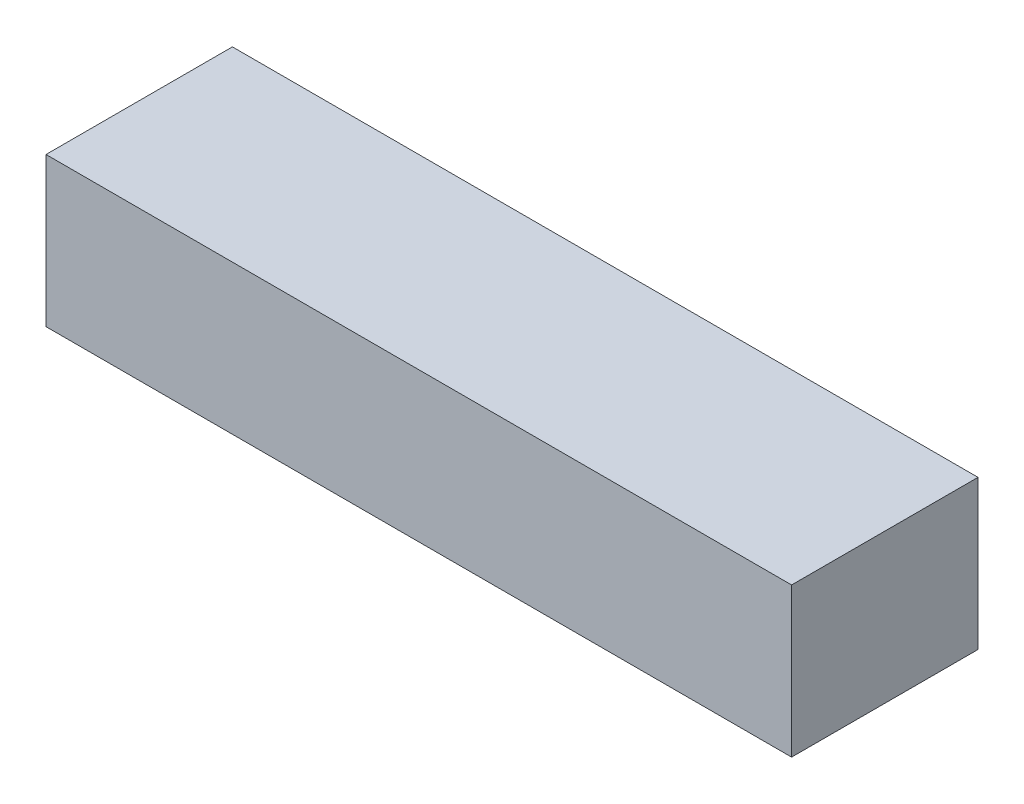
ISO-10303-21;
HEADER;
FILE_DESCRIPTION(('STEP AP214'),'2;1');
FILE_NAME('part.step','',(''),(''),'','','');
FILE_SCHEMA(('AUTOMOTIVE_DESIGN { 1 0 10303 214 1 1 1 1 }'));
ENDSEC;
DATA;
#1=APPLICATION_CONTEXT('core data for automotive mechanical design processes');
#2=APPLICATION_PROTOCOL_DEFINITION('international standard','automotive_design',2000,#1);
#3=PRODUCT_CONTEXT('',#1,'mechanical');
#4=PRODUCT('Part','Part','',(#3));
#5=PRODUCT_RELATED_PRODUCT_CATEGORY('part','',(#4));
#6=PRODUCT_DEFINITION_FORMATION('','',#4);
#7=PRODUCT_DEFINITION_CONTEXT('part definition',#1,'design');
#8=PRODUCT_DEFINITION('design','',#6,#7);
#9=PRODUCT_DEFINITION_SHAPE('','',#8);
#10=(LENGTH_UNIT() NAMED_UNIT(*) SI_UNIT(.MILLI.,.METRE.));
#11=(NAMED_UNIT(*) PLANE_ANGLE_UNIT() SI_UNIT($,.RADIAN.));
#12=(NAMED_UNIT(*) SI_UNIT($,.STERADIAN.) SOLID_ANGLE_UNIT());
#13=UNCERTAINTY_MEASURE_WITH_UNIT(LENGTH_MEASURE(1.E-05),#10,'distance_accuracy_value','');
#14=(GEOMETRIC_REPRESENTATION_CONTEXT(3) GLOBAL_UNCERTAINTY_ASSIGNED_CONTEXT((#13)) GLOBAL_UNIT_ASSIGNED_CONTEXT((#10,
#11,#12)) REPRESENTATION_CONTEXT('',''));
#15=CARTESIAN_POINT('',(0.,0.,0.));
#16=DIRECTION('',(0.,0.,1.));
#17=DIRECTION('',(1.,0.,0.));
#18=AXIS2_PLACEMENT_3D('',#15,#16,#17);
#19=CARTESIAN_POINT('',(0.,4.,5.));
#20=DIRECTION('',(1.,0.,0.));
#21=DIRECTION('',(0.,0.,-1.));
#22=AXIS2_PLACEMENT_3D('',#19,#20,#21);
#23=PLANE('',#22);
#24=DIRECTION('',(0.,0.,1.));
#25=VECTOR('',#24,1.);
#26=CARTESIAN_POINT('',(0.,0.,5.));
#27=LINE('',#26,#25);
#28=CARTESIAN_POINT('',(0.,0.,0.));
#29=VERTEX_POINT('',#28);
#30=CARTESIAN_POINT('',(0.,0.,5.));
#31=VERTEX_POINT('',#30);
#32=EDGE_CURVE('E98',#29,#31,#27,.T.);
#33=ORIENTED_EDGE('',*,*,#32,.T.);
#34=DIRECTION('',(0.,-1.,0.));
#35=VECTOR('',#34,1.);
#36=CARTESIAN_POINT('',(0.,4.,5.));
#37=LINE('',#36,#35);
#38=CARTESIAN_POINT('',(0.,4.,5.));
#39=VERTEX_POINT('',#38);
#40=EDGE_CURVE('E11',#39,#31,#37,.T.);
#41=ORIENTED_EDGE('',*,*,#40,.F.);
#42=DIRECTION('',(0.,0.,1.));
#43=VECTOR('',#42,1.);
#44=CARTESIAN_POINT('',(0.,4.,5.));
#45=LINE('',#44,#43);
#46=CARTESIAN_POINT('',(0.,4.,0.));
#47=VERTEX_POINT('',#46);
#48=EDGE_CURVE('E86',#47,#39,#45,.T.);
#49=ORIENTED_EDGE('',*,*,#48,.F.);
#50=DIRECTION('',(0.,-1.,0.));
#51=VECTOR('',#50,1.);
#52=CARTESIAN_POINT('',(0.,4.,0.));
#53=LINE('',#52,#51);
#54=EDGE_CURVE('E94',#47,#29,#53,.T.);
#55=ORIENTED_EDGE('',*,*,#54,.T.);
#56=EDGE_LOOP('',(#33,#41,#49,#55));
#57=FACE_BOUND('',#56,.T.);
#58=ADVANCED_FACE('F35',(#57),#23,.F.);
#59=CARTESIAN_POINT('',(20.,4.,5.));
#60=DIRECTION('',(0.,0.,-1.));
#61=DIRECTION('',(-1.,0.,0.));
#62=AXIS2_PLACEMENT_3D('',#59,#60,#61);
#63=PLANE('',#62);
#64=DIRECTION('',(1.,0.,0.));
#65=VECTOR('',#64,1.);
#66=CARTESIAN_POINT('',(20.,0.,5.));
#67=LINE('',#66,#65);
#68=CARTESIAN_POINT('',(20.,0.,5.));
#69=VERTEX_POINT('',#68);
#70=EDGE_CURVE('E90',#31,#69,#67,.T.);
#71=ORIENTED_EDGE('',*,*,#70,.T.);
#72=DIRECTION('',(0.,-1.,0.));
#73=VECTOR('',#72,1.);
#74=CARTESIAN_POINT('',(20.,4.,5.));
#75=LINE('',#74,#73);
#76=CARTESIAN_POINT('',(20.,4.,5.));
#77=VERTEX_POINT('',#76);
#78=EDGE_CURVE('E43',#77,#69,#75,.T.);
#79=ORIENTED_EDGE('',*,*,#78,.F.);
#80=DIRECTION('',(1.,0.,0.));
#81=VECTOR('',#80,1.);
#82=CARTESIAN_POINT('',(20.,4.,5.));
#83=LINE('',#82,#81);
#84=EDGE_CURVE('E81',#39,#77,#83,.T.);
#85=ORIENTED_EDGE('',*,*,#84,.F.);
#86=ORIENTED_EDGE('',*,*,#40,.T.);
#87=EDGE_LOOP('',(#71,#79,#85,#86));
#88=FACE_BOUND('',#87,.T.);
#89=ADVANCED_FACE('F89',(#88),#63,.F.);
#90=CARTESIAN_POINT('',(20.,4.,0.));
#91=DIRECTION('',(-1.,0.,0.));
#92=DIRECTION('',(0.,0.,1.));
#93=AXIS2_PLACEMENT_3D('',#90,#91,#92);
#94=PLANE('',#93);
#95=DIRECTION('',(0.,0.,-1.));
#96=VECTOR('',#95,1.);
#97=CARTESIAN_POINT('',(20.,0.,0.));
#98=LINE('',#97,#96);
#99=CARTESIAN_POINT('',(20.,0.,0.));
#100=VERTEX_POINT('',#99);
#101=EDGE_CURVE('E68',#69,#100,#98,.T.);
#102=ORIENTED_EDGE('',*,*,#101,.T.);
#103=DIRECTION('',(0.,-1.,0.));
#104=VECTOR('',#103,1.);
#105=CARTESIAN_POINT('',(20.,4.,0.));
#106=LINE('',#105,#104);
#107=CARTESIAN_POINT('',(20.,4.,0.));
#108=VERTEX_POINT('',#107);
#109=EDGE_CURVE('E91',#108,#100,#106,.T.);
#110=ORIENTED_EDGE('',*,*,#109,.F.);
#111=DIRECTION('',(0.,0.,-1.));
#112=VECTOR('',#111,1.);
#113=CARTESIAN_POINT('',(20.,4.,0.));
#114=LINE('',#113,#112);
#115=EDGE_CURVE('E84',#77,#108,#114,.T.);
#116=ORIENTED_EDGE('',*,*,#115,.F.);
#117=ORIENTED_EDGE('',*,*,#78,.T.);
#118=EDGE_LOOP('',(#102,#110,#116,#117));
#119=FACE_BOUND('',#118,.T.);
#120=ADVANCED_FACE('F92',(#119),#94,.F.);
#121=CARTESIAN_POINT('',(0.,4.,0.));
#122=DIRECTION('',(0.,0.,1.));
#123=DIRECTION('',(1.,0.,0.));
#124=AXIS2_PLACEMENT_3D('',#121,#122,#123);
#125=PLANE('',#124);
#126=DIRECTION('',(-1.,0.,0.));
#127=VECTOR('',#126,1.);
#128=CARTESIAN_POINT('',(0.,0.,0.));
#129=LINE('',#128,#127);
#130=EDGE_CURVE('E74',#100,#29,#129,.T.);
#131=ORIENTED_EDGE('',*,*,#130,.T.);
#132=ORIENTED_EDGE('',*,*,#54,.F.);
#133=DIRECTION('',(-1.,0.,0.));
#134=VECTOR('',#133,1.);
#135=CARTESIAN_POINT('',(0.,4.,0.));
#136=LINE('',#135,#134);
#137=EDGE_CURVE('E51',#108,#47,#136,.T.);
#138=ORIENTED_EDGE('',*,*,#137,.F.);
#139=ORIENTED_EDGE('',*,*,#109,.T.);
#140=EDGE_LOOP('',(#131,#132,#138,#139));
#141=FACE_BOUND('',#140,.T.);
#142=ADVANCED_FACE('F105',(#141),#125,.F.);
#143=CARTESIAN_POINT('',(0.,4.,0.));
#144=DIRECTION('',(0.,-1.,0.));
#145=DIRECTION('',(0.,0.,-1.));
#146=AXIS2_PLACEMENT_3D('',#143,#144,#145);
#147=PLANE('',#146);
#148=ORIENTED_EDGE('',*,*,#48,.T.);
#149=ORIENTED_EDGE('',*,*,#84,.T.);
#150=ORIENTED_EDGE('',*,*,#115,.T.);
#151=ORIENTED_EDGE('',*,*,#137,.T.);
#152=EDGE_LOOP('',(#148,#149,#150,#151));
#153=FACE_BOUND('',#152,.T.);
#154=ADVANCED_FACE('F82',(#153),#147,.F.);
#155=CARTESIAN_POINT('',(0.,0.,0.));
#156=DIRECTION('',(0.,-1.,0.));
#157=DIRECTION('',(0.,0.,-1.));
#158=AXIS2_PLACEMENT_3D('',#155,#156,#157);
#159=PLANE('',#158);
#160=ORIENTED_EDGE('',*,*,#32,.F.);
#161=ORIENTED_EDGE('',*,*,#130,.F.);
#162=ORIENTED_EDGE('',*,*,#101,.F.);
#163=ORIENTED_EDGE('',*,*,#70,.F.);
#164=EDGE_LOOP('',(#160,#161,#162,#163));
#165=FACE_BOUND('',#164,.T.);
#166=ADVANCED_FACE('F108',(#165),#159,.T.);
#167=CLOSED_SHELL('',(#58,#89,#120,#142,#154,#166));
#168=MANIFOLD_SOLID_BREP('B2',#167);
#169=ADVANCED_BREP_SHAPE_REPRESENTATION('',(#18,#168),#14);
#170=SHAPE_DEFINITION_REPRESENTATION(#9,#169);
ENDSEC;
END-ISO-10303-21;
